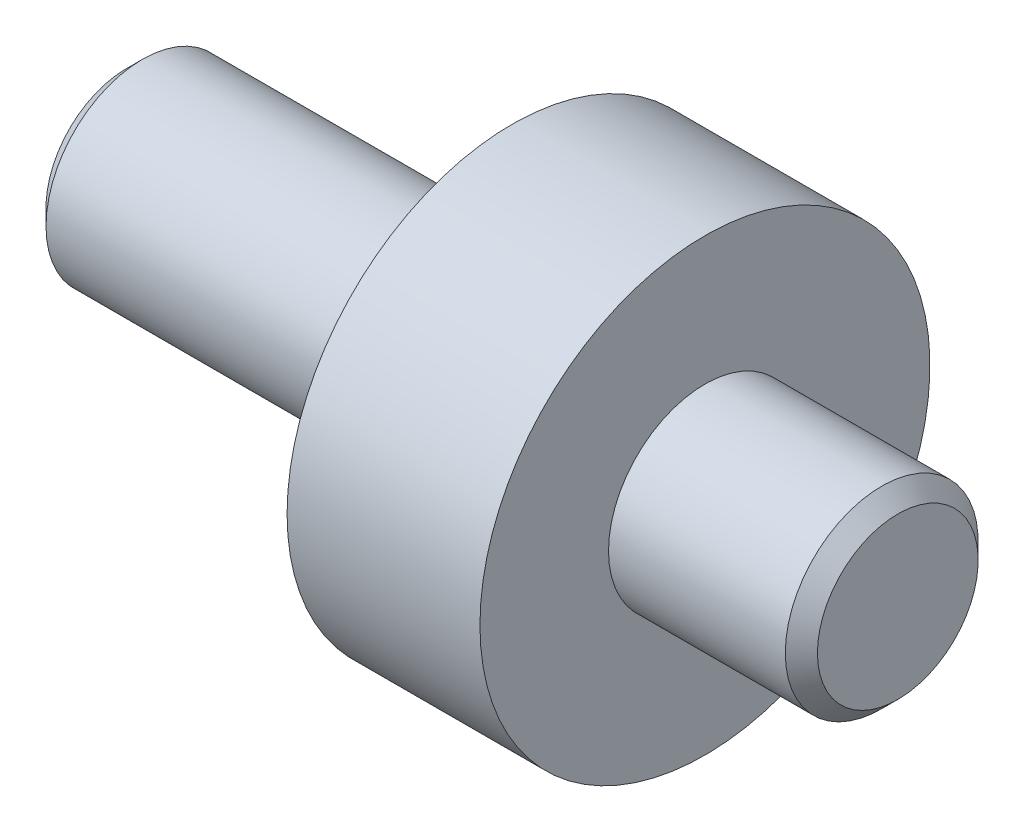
ISO-10303-21;
HEADER;
FILE_DESCRIPTION(('STEP AP214'),'2;1');
FILE_NAME('part.step','',(''),(''),'','','');
FILE_SCHEMA(('AUTOMOTIVE_DESIGN { 1 0 10303 214 1 1 1 1 }'));
ENDSEC;
DATA;
#1=APPLICATION_CONTEXT('core data for automotive mechanical design processes');
#2=APPLICATION_PROTOCOL_DEFINITION('international standard','automotive_design',2000,#1);
#3=PRODUCT_CONTEXT('',#1,'mechanical');
#4=PRODUCT('Part','Part','',(#3));
#5=PRODUCT_RELATED_PRODUCT_CATEGORY('part','',(#4));
#6=PRODUCT_DEFINITION_FORMATION('','',#4);
#7=PRODUCT_DEFINITION_CONTEXT('part definition',#1,'design');
#8=PRODUCT_DEFINITION('design','',#6,#7);
#9=PRODUCT_DEFINITION_SHAPE('','',#8);
#10=(LENGTH_UNIT() NAMED_UNIT(*) SI_UNIT(.MILLI.,.METRE.));
#11=(NAMED_UNIT(*) PLANE_ANGLE_UNIT() SI_UNIT($,.RADIAN.));
#12=(NAMED_UNIT(*) SI_UNIT($,.STERADIAN.) SOLID_ANGLE_UNIT());
#13=UNCERTAINTY_MEASURE_WITH_UNIT(LENGTH_MEASURE(1.E-05),#10,'distance_accuracy_value','');
#14=(GEOMETRIC_REPRESENTATION_CONTEXT(3) GLOBAL_UNCERTAINTY_ASSIGNED_CONTEXT((#13)) GLOBAL_UNIT_ASSIGNED_CONTEXT((#10,
#11,#12)) REPRESENTATION_CONTEXT('',''));
#15=CARTESIAN_POINT('',(0.,0.,0.));
#16=DIRECTION('',(0.,0.,1.));
#17=DIRECTION('',(1.,0.,0.));
#18=AXIS2_PLACEMENT_3D('',#15,#16,#17);
#19=CARTESIAN_POINT('',(0.,0.,0.));
#20=DIRECTION('',(1.,0.,0.));
#21=DIRECTION('',(0.,0.,-1.));
#22=AXIS2_PLACEMENT_3D('',#19,#20,#21);
#23=PLANE('',#22);
#24=CARTESIAN_POINT('',(0.,0.,0.));
#25=DIRECTION('',(1.,0.,0.));
#26=DIRECTION('',(0.,0.,-1.));
#27=AXIS2_PLACEMENT_3D('',#24,#25,#26);
#28=CIRCLE('',#27,2.5);
#29=CARTESIAN_POINT('',(0.,0.,-2.5));
#30=VERTEX_POINT('',#29);
#31=EDGE_CURVE('E28',#30,#30,#28,.F.);
#32=ORIENTED_EDGE('',*,*,#31,.T.);
#33=EDGE_LOOP('',(#32));
#34=FACE_BOUND('',#33,.T.);
#35=ADVANCED_FACE('F22',(#34),#23,.F.);
#36=CARTESIAN_POINT('',(0.,0.,0.));
#37=DIRECTION('',(-1.,0.,0.));
#38=DIRECTION('',(0.,0.,1.));
#39=AXIS2_PLACEMENT_3D('',#36,#37,#38);
#40=CYLINDRICAL_SURFACE('',#39,3.);
#41=CARTESIAN_POINT('',(0.500000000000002,0.,0.));
#42=DIRECTION('',(1.,0.,0.));
#43=DIRECTION('',(0.,0.,-1.));
#44=AXIS2_PLACEMENT_3D('',#41,#42,#43);
#45=CIRCLE('',#44,3.);
#46=CARTESIAN_POINT('',(0.500000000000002,0.,-3.));
#47=VERTEX_POINT('',#46);
#48=EDGE_CURVE('E10',#47,#47,#45,.T.);
#49=ORIENTED_EDGE('',*,*,#48,.T.);
#50=EDGE_LOOP('',(#49));
#51=FACE_BOUND('',#50,.T.);
#52=CARTESIAN_POINT('',(12.,0.,0.));
#53=DIRECTION('',(-1.,0.,0.));
#54=DIRECTION('',(0.,0.,1.));
#55=AXIS2_PLACEMENT_3D('',#52,#53,#54);
#56=CIRCLE('',#55,3.);
#57=CARTESIAN_POINT('',(12.,0.,3.));
#58=VERTEX_POINT('',#57);
#59=EDGE_CURVE('E41',#58,#58,#56,.T.);
#60=ORIENTED_EDGE('',*,*,#59,.T.);
#61=EDGE_LOOP('',(#60));
#62=FACE_BOUND('',#61,.T.);
#63=ADVANCED_FACE('F72',(#51,#62),#40,.T.);
#64=CARTESIAN_POINT('',(12.,3.,0.));
#65=DIRECTION('',(1.,0.,0.));
#66=DIRECTION('',(0.,0.,-1.));
#67=AXIS2_PLACEMENT_3D('',#64,#65,#66);
#68=PLANE('',#67);
#69=ORIENTED_EDGE('',*,*,#59,.F.);
#70=EDGE_LOOP('',(#69));
#71=FACE_BOUND('',#70,.T.);
#72=CARTESIAN_POINT('',(12.,0.,0.));
#73=DIRECTION('',(-1.,0.,0.));
#74=DIRECTION('',(0.,0.,1.));
#75=AXIS2_PLACEMENT_3D('',#72,#73,#74);
#76=CIRCLE('',#75,7.);
#77=CARTESIAN_POINT('',(12.,0.,7.));
#78=VERTEX_POINT('',#77);
#79=EDGE_CURVE('E44',#78,#78,#76,.T.);
#80=ORIENTED_EDGE('',*,*,#79,.T.);
#81=EDGE_LOOP('',(#80));
#82=FACE_BOUND('',#81,.T.);
#83=ADVANCED_FACE('F76',(#71,#82),#68,.F.);
#84=CARTESIAN_POINT('',(0.,0.,0.));
#85=DIRECTION('',(-1.,0.,0.));
#86=DIRECTION('',(0.,0.,1.));
#87=AXIS2_PLACEMENT_3D('',#84,#85,#86);
#88=CYLINDRICAL_SURFACE('',#87,7.);
#89=ORIENTED_EDGE('',*,*,#79,.F.);
#90=EDGE_LOOP('',(#89));
#91=FACE_BOUND('',#90,.T.);
#92=CARTESIAN_POINT('',(18.,0.,0.));
#93=DIRECTION('',(-1.,0.,0.));
#94=DIRECTION('',(0.,0.,1.));
#95=AXIS2_PLACEMENT_3D('',#92,#93,#94);
#96=CIRCLE('',#95,7.);
#97=CARTESIAN_POINT('',(18.,0.,7.));
#98=VERTEX_POINT('',#97);
#99=EDGE_CURVE('E47',#98,#98,#96,.T.);
#100=ORIENTED_EDGE('',*,*,#99,.T.);
#101=EDGE_LOOP('',(#100));
#102=FACE_BOUND('',#101,.T.);
#103=ADVANCED_FACE('F68',(#91,#102),#88,.T.);
#104=CARTESIAN_POINT('',(18.,7.,0.));
#105=DIRECTION('',(-1.,0.,0.));
#106=DIRECTION('',(0.,0.,1.));
#107=AXIS2_PLACEMENT_3D('',#104,#105,#106);
#108=PLANE('',#107);
#109=ORIENTED_EDGE('',*,*,#99,.F.);
#110=EDGE_LOOP('',(#109));
#111=FACE_BOUND('',#110,.T.);
#112=CARTESIAN_POINT('',(18.,0.,0.));
#113=DIRECTION('',(-1.,0.,0.));
#114=DIRECTION('',(0.,0.,1.));
#115=AXIS2_PLACEMENT_3D('',#112,#113,#114);
#116=CIRCLE('',#115,3.);
#117=CARTESIAN_POINT('',(18.,0.,3.));
#118=VERTEX_POINT('',#117);
#119=EDGE_CURVE('E50',#118,#118,#116,.T.);
#120=ORIENTED_EDGE('',*,*,#119,.T.);
#121=EDGE_LOOP('',(#120));
#122=FACE_BOUND('',#121,.T.);
#123=ADVANCED_FACE('F54',(#111,#122),#108,.F.);
#124=CARTESIAN_POINT('',(0.,0.,0.));
#125=DIRECTION('',(-1.,0.,0.));
#126=DIRECTION('',(0.,0.,1.));
#127=AXIS2_PLACEMENT_3D('',#124,#125,#126);
#128=CYLINDRICAL_SURFACE('',#127,3.);
#129=CARTESIAN_POINT('',(23.5,0.,0.));
#130=DIRECTION('',(-1.,0.,0.));
#131=DIRECTION('',(0.,0.,1.));
#132=AXIS2_PLACEMENT_3D('',#129,#130,#131);
#133=CIRCLE('',#132,3.);
#134=CARTESIAN_POINT('',(23.5,0.,3.));
#135=VERTEX_POINT('',#134);
#136=EDGE_CURVE('E36',#135,#135,#133,.T.);
#137=ORIENTED_EDGE('',*,*,#136,.T.);
#138=EDGE_LOOP('',(#137));
#139=FACE_BOUND('',#138,.T.);
#140=ORIENTED_EDGE('',*,*,#119,.F.);
#141=EDGE_LOOP('',(#140));
#142=FACE_BOUND('',#141,.T.);
#143=ADVANCED_FACE('F56',(#139,#142),#128,.T.);
#144=CARTESIAN_POINT('',(24.,3.,0.));
#145=DIRECTION('',(-1.,0.,0.));
#146=DIRECTION('',(0.,0.,1.));
#147=AXIS2_PLACEMENT_3D('',#144,#145,#146);
#148=PLANE('',#147);
#149=CARTESIAN_POINT('',(24.,0.,0.));
#150=DIRECTION('',(-1.,0.,0.));
#151=DIRECTION('',(0.,0.,1.));
#152=AXIS2_PLACEMENT_3D('',#149,#150,#151);
#153=CIRCLE('',#152,2.49999999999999);
#154=CARTESIAN_POINT('',(24.,0.,2.49999999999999));
#155=VERTEX_POINT('',#154);
#156=EDGE_CURVE('E32',#155,#155,#153,.F.);
#157=ORIENTED_EDGE('',*,*,#156,.T.);
#158=EDGE_LOOP('',(#157));
#159=FACE_BOUND('',#158,.T.);
#160=ADVANCED_FACE('F58',(#159),#148,.F.);
#161=CARTESIAN_POINT('',(23.5,0.,0.));
#162=DIRECTION('',(-1.,0.,0.));
#163=DIRECTION('',(0.,0.,1.));
#164=AXIS2_PLACEMENT_3D('',#161,#162,#163);
#165=CONICAL_SURFACE('',#164,3.,0.785398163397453);
#166=ORIENTED_EDGE('',*,*,#156,.F.);
#167=EDGE_LOOP('',(#166));
#168=FACE_BOUND('',#167,.T.);
#169=ORIENTED_EDGE('',*,*,#136,.F.);
#170=EDGE_LOOP('',(#169));
#171=FACE_BOUND('',#170,.T.);
#172=ADVANCED_FACE('F65',(#168,#171),#165,.T.);
#173=CARTESIAN_POINT('',(0.,0.,0.));
#174=DIRECTION('',(1.,0.,0.));
#175=DIRECTION('',(0.,0.,-1.));
#176=AXIS2_PLACEMENT_3D('',#173,#174,#175);
#177=CONICAL_SURFACE('',#176,2.5,0.785398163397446);
#178=ORIENTED_EDGE('',*,*,#48,.F.);
#179=EDGE_LOOP('',(#178));
#180=FACE_BOUND('',#179,.T.);
#181=ORIENTED_EDGE('',*,*,#31,.F.);
#182=EDGE_LOOP('',(#181));
#183=FACE_BOUND('',#182,.T.);
#184=ADVANCED_FACE('F111',(#180,#183),#177,.T.);
#185=CLOSED_SHELL('',(#35,#63,#83,#103,#123,#143,#160,#172,#184));
#186=MANIFOLD_SOLID_BREP('B2',#185);
#187=ADVANCED_BREP_SHAPE_REPRESENTATION('',(#18,#186),#14);
#188=SHAPE_DEFINITION_REPRESENTATION(#9,#187);
ENDSEC;
END-ISO-10303-21;
